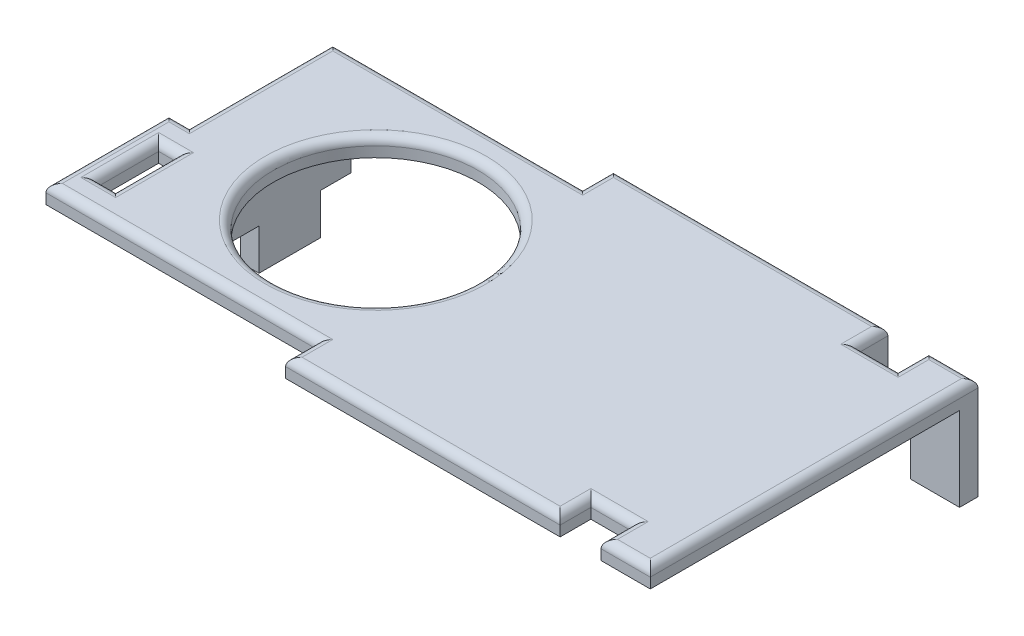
from build123d import *

# Parameters (mm, degrees)
BOSS_EXTRUDE1_DEPTH = 1.143
SKETCH4_W           = 3.048
SKETCH4_H           = 1.143
SKETCH4_W_2         = 9.017
BOSS_EXTRUDE2_DEPTH = 6.35
BOSS_EXTRUDE3_DEPTH = 1.143
SKETCH8_R           = 6.35
SKETCH8_W           = 1.143
SKETCH8_H           = 3.81
CUT_EXTRUDE1_DEPTH  = 42.647674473
FILLET1_R           = 0.508


with BuildPart() as part:
    # Sketch1 → Boss-Extrude1 (new body)
    with BuildSketch(Plane(origin=(0, 0, 0), x_dir=(1, 0, 0), z_dir=(0, 1, 0))):
        Polygon((0, -10.16), (0, 10.16), (-3.048, 10.16), (-3.048, 8.255), (-5.588, 8.255), (-5.588, 10.16), (-22.606, 10.16), (-22.606, 8.255), (-38.1, 8.255), (-38.1, -0.635), (-39.37, -0.635), (-39.37, -8.255), (-22.606, -8.255), (-22.606, -10.16), (-5.588, -10.16), (-5.588, -8.255), (-3.048, -8.255), (-3.048, -10.16), align=None)
    extrude(amount=BOSS_EXTRUDE1_DEPTH)

    # Sketch4 → Boss-Extrude2 (add)
    with BuildSketch(Plane(origin=(0, 1.143, 0), x_dir=(1, 0, 0), z_dir=(0, 1, 0))):
        with Locations((-1.524, 9.5885)):
            Rectangle(SKETCH4_W, SKETCH4_H)
        with Locations((-10.0965, 9.5885)):
            Rectangle(SKETCH4_W_2, SKETCH4_H)
    extrude(amount=-BOSS_EXTRUDE2_DEPTH)

    # Sketch7 → Boss-Extrude3 (add)
    with BuildSketch(Plane.ZY.offset(38.1)):
        Polygon((-0.635, 1.143), (-8.255, 1.143), (-8.255, -5.334), (-6.35, -5.334), (-6.35, -7.874), (-2.54, -7.874), (-2.54, -5.334), (-0.635, -5.334), align=None)
    extrude(amount=-BOSS_EXTRUDE3_DEPTH)

    # Sketch8 → Cut-Extrude1 (cut, through all)
    with BuildSketch(Plane(origin=(0, 1.143, 0), x_dir=(1, 0, 0), z_dir=(0, 1, 0))):
        with Locations(Location((-27.178, 0, 0), (0, 0, 270))):
            Circle(SKETCH8_R)
        with Locations((-37.5285, -4.445)):
            Rectangle(SKETCH8_W, SKETCH8_H)
    extrude(amount=-CUT_EXTRUDE1_DEPTH, mode=Mode.SUBTRACT)

    # Fillet1
    fillet1_edges = [part.edges().sort_by_distance(p)[0] for p in [
        (-5.588, 1.143, 9.2075),
        (-27.178, 1.143, -6.35),
        (-38.1, 1.143, 4.445),
        (-37.5285, 1.143, 6.35),
        (-36.957, 1.143, 4.445),
        (-37.5285, 1.143, 2.54),
        (-4.318, 1.143, 8.255),
        (-3.048, 1.143, 9.2075),
        (-1.524, 1.143, 10.16),
        (0, 1.143, 0),
        (-1.524, 1.143, -10.16),
        (-3.048, 1.143, -9.2075),
        (-4.318, 1.143, -8.255),
        (-5.588, 1.143, -9.2075),
        (-14.097, 1.143, -10.16),
        (-22.606, 1.143, 9.2075),
        (-22.606, 1.143, -9.2075),
        (-30.353, 1.143, -8.255),
        (-38.1, 1.143, -3.81),
        (-38.735, 1.143, 0.635),
        (-39.37, 1.143, 4.445),
        (-30.988, 1.143, 8.255),
        (-14.097, 1.143, 10.16),
    ]]
    fillet(fillet1_edges, radius=FILLET1_R)


solid = part.part
